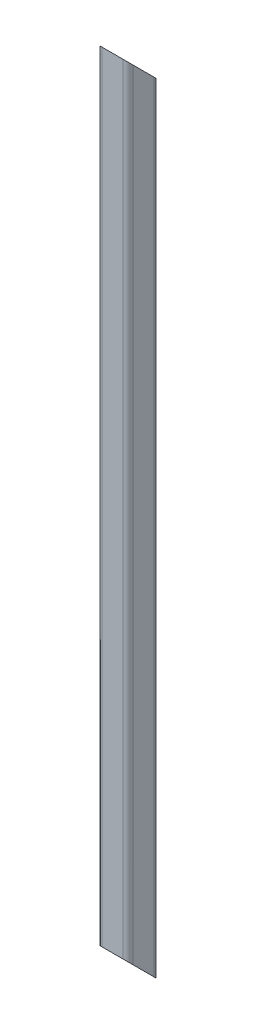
from build123d import *

# Parameters (mm, degrees)
EXTRUDE_THIN1_DEPTH = 1003.3
EXTRUDE1_DEPTH      = 1005.203865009


with BuildPart() as part:
    # Sketch1 → Extrude-Thin1 (new body)
    with BuildSketch(Plane(origin=(0, 0, 0), x_dir=(1, 0, 0), z_dir=(0, 1, 0))):
        with BuildLine():
            Line((19.05, 12.97432), (19.05, -12.97432))
            ThreePointArc((19.05, -12.97432), (17.270474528, -17.270474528), (12.97432, -19.05))
            Line((12.97432, -19.05), (-12.97432, -19.05))
            ThreePointArc((-12.97432, -19.05), (-17.270474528, -17.270474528), (-19.05, -12.97432))
            Line((-19.05, -12.97432), (-19.05, 12.97432))
            ThreePointArc((-19.05, 12.97432), (-17.270474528, 17.270474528), (-12.97432, 19.05))
            Line((-12.97432, 19.05), (12.97432, 19.05))
            ThreePointArc((12.97432, 19.05), (17.270474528, 17.270474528), (19.05, 12.97432))
        make_face()
        with BuildLine():
            Line((16.01216, 12.97432), (16.01216, -12.97432))
            ThreePointArc((16.01216, -12.97432), (15.122397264, -15.122397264), (12.97432, -16.01216))
            Line((12.97432, -16.01216), (-12.97432, -16.01216))
            ThreePointArc((-12.97432, -16.01216), (-15.122397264, -15.122397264), (-16.01216, -12.97432))
            Line((-16.01216, -12.97432), (-16.01216, 12.97432))
            ThreePointArc((-16.01216, 12.97432), (-15.122397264, 15.122397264), (-12.97432, 16.01216))
            Line((-12.97432, 16.01216), (12.97432, 16.01216))
            ThreePointArc((12.97432, 16.01216), (15.122397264, 15.122397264), (16.01216, 12.97432))
        make_face(mode=Mode.SUBTRACT)
    extrude(amount=EXTRUDE_THIN1_DEPTH)

    # Sketch2 → Extrude1 (cut, through all)
    with BuildSketch(Plane(origin=(19.05, 0, 0), x_dir=(0, 0, -1), z_dir=(1, 0, 0))):
        Polygon((-19.05, 1003.3), (19.05, 965.2), (19.05, 1003.3), align=None)
        Polygon((19.05, 0), (-19.05, 38.1), (-19.05, 0), align=None)
    extrude(amount=-EXTRUDE1_DEPTH, mode=Mode.SUBTRACT)


solid = part.part
